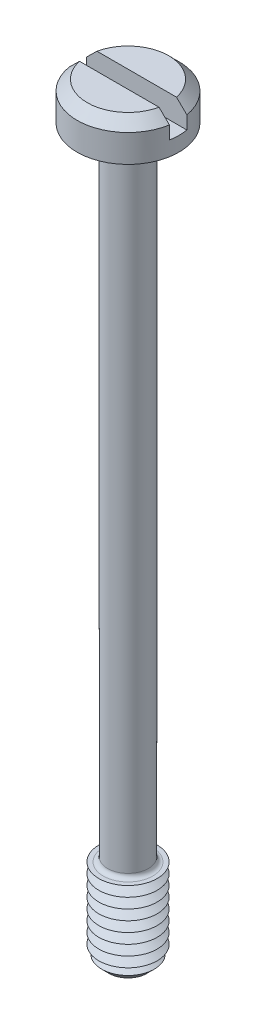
from build123d import *

# Parameters (mm, degrees)
SKETCH1_R           = 3.5
BOSS_EXTRUDE1_DEPTH = 2.6
SKETCH2_R           = 1.4
BOSS_EXTRUDE2_DEPTH = 50
SKETCH3_R           = 2
BOSS_EXTRUDE3_DEPTH = 6
CHAMFER1_SIZE       = 0.7
LPATTERN1_COUNT     = 8
LPATTERN1_PITCH     = 0.7
FILLET1_R           = 0.3
CHAMFER2_SIZE       = 0.7
SKETCH6_W           = 7
SKETCH6_H           = 1.2
CUT_EXTRUDE1_DEPTH  = 1.6


with BuildPart() as part:
    # Sketch1 → Boss-Extrude1 (new body)
    with BuildSketch(Plane(origin=(0, 0, 0), x_dir=(1, 0, 0), z_dir=(0, 1, 0))):
        with Locations(Location((0, 0, 0), (0, 0, 270))):
            Circle(SKETCH1_R)
    extrude(amount=BOSS_EXTRUDE1_DEPTH)

    # Sketch2 → Boss-Extrude2 (add)
    with BuildSketch(Plane.XZ):
        with Locations(Location((0, 0, 0), (0, 0, 270))):
            Circle(SKETCH2_R)
    extrude(amount=BOSS_EXTRUDE2_DEPTH)

    # Sketch3 → Boss-Extrude3 (add)
    with BuildSketch(Plane.XZ.offset(50)):
        with Locations(Location((0, 0, 0), (0, 0, 270))):
            Circle(SKETCH3_R)
    extrude(amount=-BOSS_EXTRUDE3_DEPTH)

    # Chamfer1
    chamfer1_edges = [part.edges().sort_by_distance(p)[0] for p in [
        (0, -50, 2),
    ]]
    chamfer(chamfer1_edges, length=CHAMFER1_SIZE)

    # Sketch5 → Cut-Revolve1 (revolve, cut)
    with BuildSketch(Plane(origin=(0, 0, 0), x_dir=(0, 0, -1), z_dir=(1, 0, 0))):
        Polygon((-2, -44), (-1.393782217, -44.35), (-2, -44.7), align=None)
    cut_revolve1 = revolve(axis=Axis((0, -6.58711856, 0), (0, -1, 0)), mode=Mode.SUBTRACT)

    # LPattern1: Cut-Revolve1 ×8
    with Locations(*[(0, -i * LPATTERN1_PITCH, 0) for i in range(1, LPATTERN1_COUNT)]):
        add(cut_revolve1, mode=Mode.SUBTRACT)

    # Fillet1
    fillet1_edges = [part.edges().sort_by_distance(p)[0] for p in [
        (0, 0, 1.4),
        (0, -44, 1.4),
    ]]
    fillet(fillet1_edges, radius=FILLET1_R)

    # Chamfer2
    chamfer2_edges = [part.edges().sort_by_distance(p)[0] for p in [
        (0, 2.6, -3.5),
    ]]
    chamfer(chamfer2_edges, length=CHAMFER2_SIZE)

    # Sketch6 → Cut-Extrude1 (cut)
    with BuildSketch(Plane(origin=(0, 2.6, 0), x_dir=(1, 0, 0), z_dir=(0, 1, 0))):
        Rectangle(SKETCH6_W, SKETCH6_H)
    extrude(amount=-CUT_EXTRUDE1_DEPTH, mode=Mode.SUBTRACT)


solid = part.part
